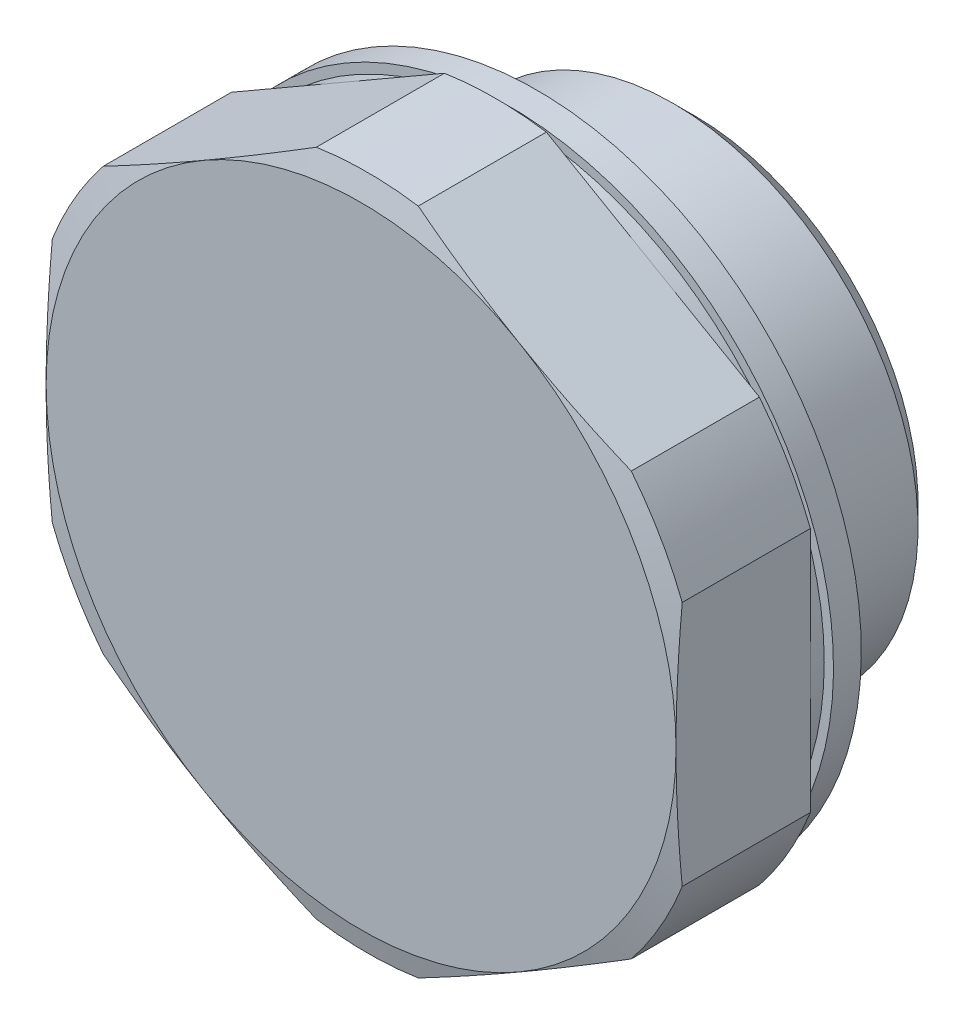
ISO-10303-21;
HEADER;
FILE_DESCRIPTION(('STEP AP214'),'2;1');
FILE_NAME('part.step','',(''),(''),'','','');
FILE_SCHEMA(('AUTOMOTIVE_DESIGN { 1 0 10303 214 1 1 1 1 }'));
ENDSEC;
DATA;
#1=APPLICATION_CONTEXT('core data for automotive mechanical design processes');
#2=APPLICATION_PROTOCOL_DEFINITION('international standard','automotive_design',2000,#1);
#3=PRODUCT_CONTEXT('',#1,'mechanical');
#4=PRODUCT('Part','Part','',(#3));
#5=PRODUCT_RELATED_PRODUCT_CATEGORY('part','',(#4));
#6=PRODUCT_DEFINITION_FORMATION('','',#4);
#7=PRODUCT_DEFINITION_CONTEXT('part definition',#1,'design');
#8=PRODUCT_DEFINITION('design','',#6,#7);
#9=PRODUCT_DEFINITION_SHAPE('','',#8);
#10=(LENGTH_UNIT() NAMED_UNIT(*) SI_UNIT(.MILLI.,.METRE.));
#11=(NAMED_UNIT(*) PLANE_ANGLE_UNIT() SI_UNIT($,.RADIAN.));
#12=(NAMED_UNIT(*) SI_UNIT($,.STERADIAN.) SOLID_ANGLE_UNIT());
#13=UNCERTAINTY_MEASURE_WITH_UNIT(LENGTH_MEASURE(1.E-05),#10,'distance_accuracy_value','');
#14=(GEOMETRIC_REPRESENTATION_CONTEXT(3) GLOBAL_UNCERTAINTY_ASSIGNED_CONTEXT((#13)) GLOBAL_UNIT_ASSIGNED_CONTEXT((#10,
#11,#12)) REPRESENTATION_CONTEXT('',''));
#15=CARTESIAN_POINT('',(0.,0.,0.));
#16=DIRECTION('',(0.,0.,1.));
#17=DIRECTION('',(1.,0.,0.));
#18=AXIS2_PLACEMENT_3D('',#15,#16,#17);
#19=CARTESIAN_POINT('',(0.,0.,-2.99999999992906));
#20=DIRECTION('',(0.,0.,-1.));
#21=DIRECTION('',(0.,1.,0.));
#22=AXIS2_PLACEMENT_3D('',#19,#20,#21);
#23=CONICAL_SURFACE('',#22,6.50000000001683,1.02974425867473);
#24=CARTESIAN_POINT('',(0.,0.,0.905594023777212));
#25=VERTEX_POINT('',#24);
#26=VERTEX_LOOP('',#25);
#27=FACE_BOUND('',#26,.T.);
#28=CARTESIAN_POINT('',(0.,0.,-3.));
#29=DIRECTION('',(0.,0.,1.));
#30=DIRECTION('',(0.,-1.,0.));
#31=AXIS2_PLACEMENT_3D('',#28,#29,#30);
#32=CIRCLE('',#31,6.5);
#33=CARTESIAN_POINT('',(0.,-6.5,-3.));
#34=VERTEX_POINT('',#33);
#35=EDGE_CURVE('E410',#34,#34,#32,.F.);
#36=ORIENTED_EDGE('',*,*,#35,.T.);
#37=EDGE_LOOP('',(#36));
#38=FACE_BOUND('',#37,.T.);
#39=ADVANCED_FACE('F14',(#27,#38),#23,.F.);
#40=CARTESIAN_POINT('',(0.,0.,-10.));
#41=DIRECTION('',(0.,0.,1.));
#42=DIRECTION('',(0.,-1.,0.));
#43=AXIS2_PLACEMENT_3D('',#40,#41,#42);
#44=CYLINDRICAL_SURFACE('',#43,6.5);
#45=CARTESIAN_POINT('',(0.,0.,-10.));
#46=DIRECTION('',(0.,0.,1.));
#47=DIRECTION('',(0.,-1.,0.));
#48=AXIS2_PLACEMENT_3D('',#45,#46,#47);
#49=CIRCLE('',#48,6.5);
#50=CARTESIAN_POINT('',(0.,-6.5,-10.));
#51=VERTEX_POINT('',#50);
#52=EDGE_CURVE('E17',#51,#51,#49,.F.);
#53=ORIENTED_EDGE('',*,*,#52,.T.);
#54=EDGE_LOOP('',(#53));
#55=FACE_BOUND('',#54,.T.);
#56=ORIENTED_EDGE('',*,*,#35,.F.);
#57=EDGE_LOOP('',(#56));
#58=FACE_BOUND('',#57,.T.);
#59=ADVANCED_FACE('F777',(#55,#58),#44,.F.);
#60=CARTESIAN_POINT('',(12.0585,0.,-10.));
#61=DIRECTION('',(0.,0.,1.));
#62=DIRECTION('',(0.,-1.,0.));
#63=AXIS2_PLACEMENT_3D('',#60,#61,#62);
#64=PLANE('',#63);
#65=CARTESIAN_POINT('',(0.,0.,-10.));
#66=DIRECTION('',(0.,0.,1.));
#67=DIRECTION('',(0.,-1.,0.));
#68=AXIS2_PLACEMENT_3D('',#65,#66,#67);
#69=CIRCLE('',#68,12.0585);
#70=CARTESIAN_POINT('',(0.,-12.0585,-10.));
#71=VERTEX_POINT('',#70);
#72=EDGE_CURVE('E407',#71,#71,#69,.T.);
#73=ORIENTED_EDGE('',*,*,#72,.F.);
#74=EDGE_LOOP('',(#73));
#75=FACE_BOUND('',#74,.T.);
#76=ORIENTED_EDGE('',*,*,#52,.F.);
#77=EDGE_LOOP('',(#76));
#78=FACE_BOUND('',#77,.T.);
#79=ADVANCED_FACE('F768',(#75,#78),#64,.F.);
#80=CARTESIAN_POINT('',(0.,0.,-8.838));
#81=DIRECTION('',(0.,0.,1.));
#82=DIRECTION('',(0.,-1.,0.));
#83=AXIS2_PLACEMENT_3D('',#80,#81,#82);
#84=CONICAL_SURFACE('',#83,13.2205,0.785398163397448);
#85=CARTESIAN_POINT('',(0.,0.,-8.838));
#86=DIRECTION('',(0.,0.,1.));
#87=DIRECTION('',(0.,-1.,0.));
#88=AXIS2_PLACEMENT_3D('',#85,#86,#87);
#89=CIRCLE('',#88,13.2205);
#90=CARTESIAN_POINT('',(0.,-13.2205,-8.838));
#91=VERTEX_POINT('',#90);
#92=EDGE_CURVE('E402',#91,#91,#89,.T.);
#93=ORIENTED_EDGE('',*,*,#92,.F.);
#94=EDGE_LOOP('',(#93));
#95=FACE_BOUND('',#94,.T.);
#96=ORIENTED_EDGE('',*,*,#72,.T.);
#97=EDGE_LOOP('',(#96));
#98=FACE_BOUND('',#97,.T.);
#99=ADVANCED_FACE('F759',(#95,#98),#84,.T.);
#100=CARTESIAN_POINT('',(0.,0.,-10.));
#101=DIRECTION('',(0.,0.,1.));
#102=DIRECTION('',(0.,-1.,0.));
#103=AXIS2_PLACEMENT_3D('',#100,#101,#102);
#104=CYLINDRICAL_SURFACE('',#103,13.2205);
#105=CARTESIAN_POINT('',(0.,0.,-3.67088101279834));
#106=DIRECTION('',(0.,0.,-1.));
#107=DIRECTION('',(0.,1.,0.));
#108=AXIS2_PLACEMENT_3D('',#105,#106,#107);
#109=CIRCLE('',#108,13.2205);
#110=CARTESIAN_POINT('',(0.,13.2205,-3.67088101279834));
#111=VERTEX_POINT('',#110);
#112=EDGE_CURVE('E398',#111,#111,#109,.F.);
#113=ORIENTED_EDGE('',*,*,#112,.F.);
#114=EDGE_LOOP('',(#113));
#115=FACE_BOUND('',#114,.T.);
#116=ORIENTED_EDGE('',*,*,#92,.T.);
#117=EDGE_LOOP('',(#116));
#118=FACE_BOUND('',#117,.T.);
#119=ADVANCED_FACE('F750',(#115,#118),#104,.T.);
#120=CARTESIAN_POINT('',(0.,0.,-3.67088101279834));
#121=DIRECTION('',(0.,0.,-1.));
#122=DIRECTION('',(0.,1.,0.));
#123=AXIS2_PLACEMENT_3D('',#120,#121,#122);
#124=CONICAL_SURFACE('',#123,13.2205,1.0471975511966);
#125=CARTESIAN_POINT('',(0.,0.,-3.));
#126=DIRECTION('',(0.,0.,-1.));
#127=DIRECTION('',(0.,1.,0.));
#128=AXIS2_PLACEMENT_3D('',#125,#126,#127);
#129=CIRCLE('',#128,12.0585);
#130=CARTESIAN_POINT('',(0.,12.0585,-3.));
#131=VERTEX_POINT('',#130);
#132=EDGE_CURVE('E401',#131,#131,#129,.T.);
#133=ORIENTED_EDGE('',*,*,#132,.T.);
#134=EDGE_LOOP('',(#133));
#135=FACE_BOUND('',#134,.T.);
#136=ORIENTED_EDGE('',*,*,#112,.T.);
#137=EDGE_LOOP('',(#136));
#138=FACE_BOUND('',#137,.T.);
#139=ADVANCED_FACE('F741',(#135,#138),#124,.T.);
#140=CARTESIAN_POINT('',(11.25,0.,-3.));
#141=DIRECTION('',(0.,0.,-1.));
#142=DIRECTION('',(0.,1.,0.));
#143=AXIS2_PLACEMENT_3D('',#140,#141,#142);
#144=PLANE('',#143);
#145=CARTESIAN_POINT('',(0.,0.,-3.));
#146=DIRECTION('',(0.,0.,1.));
#147=DIRECTION('',(0.,-1.,0.));
#148=AXIS2_PLACEMENT_3D('',#145,#146,#147);
#149=CIRCLE('',#148,11.25);
#150=CARTESIAN_POINT('',(0.,-11.25,-3.));
#151=VERTEX_POINT('',#150);
#152=EDGE_CURVE('E425',#151,#151,#149,.T.);
#153=ORIENTED_EDGE('',*,*,#152,.F.);
#154=EDGE_LOOP('',(#153));
#155=FACE_BOUND('',#154,.T.);
#156=ORIENTED_EDGE('',*,*,#132,.F.);
#157=EDGE_LOOP('',(#156));
#158=FACE_BOUND('',#157,.T.);
#159=ADVANCED_FACE('F732',(#155,#158),#144,.F.);
#160=CARTESIAN_POINT('',(0.,0.,0.));
#161=DIRECTION('',(0.,0.,1.));
#162=DIRECTION('',(0.,-1.,0.));
#163=AXIS2_PLACEMENT_3D('',#160,#161,#162);
#164=CONICAL_SURFACE('',#163,12.5,0.394791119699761);
#165=CARTESIAN_POINT('',(0.,0.,0.));
#166=DIRECTION('',(0.,0.,1.));
#167=DIRECTION('',(0.,-1.,0.));
#168=AXIS2_PLACEMENT_3D('',#165,#166,#167);
#169=CIRCLE('',#168,12.5);
#170=CARTESIAN_POINT('',(0.,-12.5,0.));
#171=VERTEX_POINT('',#170);
#172=EDGE_CURVE('E428',#171,#171,#169,.F.);
#173=ORIENTED_EDGE('',*,*,#172,.T.);
#174=EDGE_LOOP('',(#173));
#175=FACE_BOUND('',#174,.T.);
#176=ORIENTED_EDGE('',*,*,#152,.T.);
#177=EDGE_LOOP('',(#176));
#178=FACE_BOUND('',#177,.T.);
#179=ADVANCED_FACE('F723',(#175,#178),#164,.T.);
#180=CARTESIAN_POINT('',(17.,0.,0.));
#181=DIRECTION('',(0.,0.,1.));
#182=DIRECTION('',(0.,-1.,0.));
#183=AXIS2_PLACEMENT_3D('',#180,#181,#182);
#184=PLANE('',#183);
#185=CARTESIAN_POINT('',(0.,0.,0.));
#186=DIRECTION('',(0.,0.,1.));
#187=DIRECTION('',(0.,-1.,0.));
#188=AXIS2_PLACEMENT_3D('',#185,#186,#187);
#189=CIRCLE('',#188,13.2205);
#190=CARTESIAN_POINT('',(0.,-13.2205,0.));
#191=VERTEX_POINT('',#190);
#192=EDGE_CURVE('E431',#191,#191,#189,.F.);
#193=ORIENTED_EDGE('',*,*,#192,.T.);
#194=EDGE_LOOP('',(#193));
#195=FACE_BOUND('',#194,.T.);
#196=ORIENTED_EDGE('',*,*,#172,.F.);
#197=EDGE_LOOP('',(#196));
#198=FACE_BOUND('',#197,.T.);
#199=ADVANCED_FACE('F714',(#195,#198),#184,.F.);
#200=CARTESIAN_POINT('',(0.,0.,-1.5));
#201=DIRECTION('',(0.,0.,1.));
#202=DIRECTION('',(0.,-1.,0.));
#203=AXIS2_PLACEMENT_3D('',#200,#201,#202);
#204=CYLINDRICAL_SURFACE('',#203,13.2205);
#205=ORIENTED_EDGE('',*,*,#192,.F.);
#206=EDGE_LOOP('',(#205));
#207=FACE_BOUND('',#206,.T.);
#208=CARTESIAN_POINT('',(0.,0.,-1.5));
#209=DIRECTION('',(0.,0.,1.));
#210=DIRECTION('',(0.,-1.,0.));
#211=AXIS2_PLACEMENT_3D('',#208,#209,#210);
#212=CIRCLE('',#211,13.2205);
#213=CARTESIAN_POINT('',(0.,-13.2205,-1.5));
#214=VERTEX_POINT('',#213);
#215=EDGE_CURVE('E434',#214,#214,#212,.T.);
#216=ORIENTED_EDGE('',*,*,#215,.F.);
#217=EDGE_LOOP('',(#216));
#218=FACE_BOUND('',#217,.T.);
#219=ADVANCED_FACE('F705',(#207,#218),#204,.F.);
#220=CARTESIAN_POINT('',(13.2205,0.,-1.5));
#221=DIRECTION('',(0.,0.,-1.));
#222=DIRECTION('',(0.,1.,0.));
#223=AXIS2_PLACEMENT_3D('',#220,#221,#222);
#224=PLANE('',#223);
#225=ORIENTED_EDGE('',*,*,#215,.T.);
#226=EDGE_LOOP('',(#225));
#227=FACE_BOUND('',#226,.T.);
#228=CARTESIAN_POINT('',(0.,0.,-1.5));
#229=DIRECTION('',(0.,0.,1.));
#230=DIRECTION('',(0.,-1.,0.));
#231=AXIS2_PLACEMENT_3D('',#228,#229,#230);
#232=CIRCLE('',#231,17.5);
#233=CARTESIAN_POINT('',(0.,-17.5,-1.5));
#234=VERTEX_POINT('',#233);
#235=EDGE_CURVE('E437',#234,#234,#232,.T.);
#236=ORIENTED_EDGE('',*,*,#235,.F.);
#237=EDGE_LOOP('',(#236));
#238=FACE_BOUND('',#237,.T.);
#239=ADVANCED_FACE('F696',(#227,#238),#224,.T.);
#240=CARTESIAN_POINT('',(0.,0.,-1.5));
#241=DIRECTION('',(0.,0.,1.));
#242=DIRECTION('',(0.,-1.,0.));
#243=AXIS2_PLACEMENT_3D('',#240,#241,#242);
#244=CYLINDRICAL_SURFACE('',#243,17.5);
#245=ORIENTED_EDGE('',*,*,#235,.T.);
#246=EDGE_LOOP('',(#245));
#247=FACE_BOUND('',#246,.T.);
#248=CARTESIAN_POINT('',(0.,0.,0.));
#249=DIRECTION('',(0.,0.,1.));
#250=DIRECTION('',(0.,-1.,0.));
#251=AXIS2_PLACEMENT_3D('',#248,#249,#250);
#252=CIRCLE('',#251,17.5);
#253=CARTESIAN_POINT('',(0.,-17.5,0.));
#254=VERTEX_POINT('',#253);
#255=EDGE_CURVE('E440',#254,#254,#252,.T.);
#256=ORIENTED_EDGE('',*,*,#255,.F.);
#257=EDGE_LOOP('',(#256));
#258=FACE_BOUND('',#257,.T.);
#259=ADVANCED_FACE('F687',(#247,#258),#244,.T.);
#260=CARTESIAN_POINT('',(17.5,0.,0.));
#261=DIRECTION('',(0.,0.,1.));
#262=DIRECTION('',(0.,-1.,0.));
#263=AXIS2_PLACEMENT_3D('',#260,#261,#262);
#264=PLANE('',#263);
#265=ORIENTED_EDGE('',*,*,#255,.T.);
#266=EDGE_LOOP('',(#265));
#267=FACE_BOUND('',#266,.T.);
#268=CARTESIAN_POINT('',(0.,0.,0.));
#269=DIRECTION('',(0.,0.,1.));
#270=DIRECTION('',(0.,-1.,0.));
#271=AXIS2_PLACEMENT_3D('',#268,#269,#270);
#272=CIRCLE('',#271,17.);
#273=CARTESIAN_POINT('',(0.,-17.,0.));
#274=VERTEX_POINT('',#273);
#275=EDGE_CURVE('E443',#274,#274,#272,.T.);
#276=ORIENTED_EDGE('',*,*,#275,.F.);
#277=EDGE_LOOP('',(#276));
#278=FACE_BOUND('',#277,.T.);
#279=ADVANCED_FACE('F679',(#267,#278),#264,.T.);
#280=CARTESIAN_POINT('',(0.,0.,-10.));
#281=DIRECTION('',(0.,0.,1.));
#282=DIRECTION('',(0.,-1.,0.));
#283=AXIS2_PLACEMENT_3D('',#280,#281,#282);
#284=CYLINDRICAL_SURFACE('',#283,17.);
#285=CARTESIAN_POINT('',(0.,0.,0.75));
#286=DIRECTION('',(0.,0.,1.));
#287=DIRECTION('',(0.,-1.,0.));
#288=AXIS2_PLACEMENT_3D('',#285,#286,#287);
#289=CIRCLE('',#288,17.);
#290=CARTESIAN_POINT('',(-8.5,14.7224318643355,0.75));
#291=VERTEX_POINT('',#290);
#292=CARTESIAN_POINT('',(8.5,14.7224318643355,0.75));
#293=VERTEX_POINT('',#292);
#294=EDGE_CURVE('E450',#291,#293,#289,.F.);
#295=ORIENTED_EDGE('',*,*,#294,.T.);
#296=CARTESIAN_POINT('',(0.,0.,0.75));
#297=DIRECTION('',(0.,0.,1.));
#298=DIRECTION('',(0.,-1.,0.));
#299=AXIS2_PLACEMENT_3D('',#296,#297,#298);
#300=CIRCLE('',#299,17.);
#301=CARTESIAN_POINT('',(17.,0.,0.75));
#302=VERTEX_POINT('',#301);
#303=EDGE_CURVE('E453',#293,#302,#300,.F.);
#304=ORIENTED_EDGE('',*,*,#303,.T.);
#305=CARTESIAN_POINT('',(0.,0.,0.75));
#306=DIRECTION('',(0.,0.,1.));
#307=DIRECTION('',(0.,-1.,0.));
#308=AXIS2_PLACEMENT_3D('',#305,#306,#307);
#309=CIRCLE('',#308,17.);
#310=CARTESIAN_POINT('',(8.5,-14.7224318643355,0.75));
#311=VERTEX_POINT('',#310);
#312=EDGE_CURVE('E456',#302,#311,#309,.F.);
#313=ORIENTED_EDGE('',*,*,#312,.T.);
#314=CARTESIAN_POINT('',(0.,0.,0.75));
#315=DIRECTION('',(0.,0.,1.));
#316=DIRECTION('',(0.,-1.,0.));
#317=AXIS2_PLACEMENT_3D('',#314,#315,#316);
#318=CIRCLE('',#317,17.);
#319=CARTESIAN_POINT('',(-8.5,-14.7224318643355,0.75));
#320=VERTEX_POINT('',#319);
#321=EDGE_CURVE('E459',#311,#320,#318,.F.);
#322=ORIENTED_EDGE('',*,*,#321,.T.);
#323=CARTESIAN_POINT('',(0.,0.,0.75));
#324=DIRECTION('',(0.,0.,1.));
#325=DIRECTION('',(0.,-1.,0.));
#326=AXIS2_PLACEMENT_3D('',#323,#324,#325);
#327=CIRCLE('',#326,17.);
#328=CARTESIAN_POINT('',(-17.,0.,0.75));
#329=VERTEX_POINT('',#328);
#330=EDGE_CURVE('E136',#320,#329,#327,.F.);
#331=ORIENTED_EDGE('',*,*,#330,.T.);
#332=CARTESIAN_POINT('',(0.,0.,0.75));
#333=DIRECTION('',(0.,0.,1.));
#334=DIRECTION('',(0.,-1.,0.));
#335=AXIS2_PLACEMENT_3D('',#332,#333,#334);
#336=CIRCLE('',#335,17.);
#337=EDGE_CURVE('E447',#329,#291,#336,.F.);
#338=ORIENTED_EDGE('',*,*,#337,.T.);
#339=EDGE_LOOP('',(#295,#304,#313,#322,#331,#338));
#340=FACE_BOUND('',#339,.T.);
#341=ORIENTED_EDGE('',*,*,#275,.T.);
#342=EDGE_LOOP('',(#341));
#343=FACE_BOUND('',#342,.T.);
#344=ADVANCED_FACE('F480',(#340,#343),#284,.T.);
#345=CARTESIAN_POINT('',(21.25,0.,0.75));
#346=DIRECTION('',(0.,0.,1.));
#347=DIRECTION('',(0.,-1.,0.));
#348=AXIS2_PLACEMENT_3D('',#345,#346,#347);
#349=PLANE('',#348);
#350=DIRECTION('',(0.,-1.,0.));
#351=VECTOR('',#350,1.);
#352=CARTESIAN_POINT('',(-17.,9.81495457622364,0.75));
#353=LINE('',#352,#351);
#354=CARTESIAN_POINT('',(-17.,-6.63795902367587,0.75));
#355=VERTEX_POINT('',#354);
#356=EDGE_CURVE('E387',#329,#355,#353,.T.);
#357=ORIENTED_EDGE('',*,*,#356,.F.);
#358=ORIENTED_EDGE('',*,*,#330,.F.);
#359=DIRECTION('',(0.866025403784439,-0.5,0.));
#360=VECTOR('',#359,1.);
#361=CARTESIAN_POINT('',(-17.,-9.81495457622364,0.75));
#362=LINE('',#361,#360);
#363=CARTESIAN_POINT('',(-14.2486411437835,-11.4034523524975,0.75));
#364=VERTEX_POINT('',#363);
#365=EDGE_CURVE('E391',#364,#320,#362,.T.);
#366=ORIENTED_EDGE('',*,*,#365,.F.);
#367=CARTESIAN_POINT('',(0.,0.,0.75));
#368=DIRECTION('',(0.,0.,-1.));
#369=DIRECTION('',(0.,1.,0.));
#370=AXIS2_PLACEMENT_3D('',#367,#368,#369);
#371=CIRCLE('',#370,18.25);
#372=EDGE_CURVE('E397',#355,#364,#371,.F.);
#373=ORIENTED_EDGE('',*,*,#372,.F.);
#374=EDGE_LOOP('',(#357,#358,#366,#373));
#375=FACE_BOUND('',#374,.T.);
#376=ADVANCED_FACE('F663',(#375),#349,.F.);
#377=CARTESIAN_POINT('',(21.25,0.,0.75));
#378=DIRECTION('',(0.,0.,1.));
#379=DIRECTION('',(0.,-1.,0.));
#380=AXIS2_PLACEMENT_3D('',#377,#378,#379);
#381=PLANE('',#380);
#382=DIRECTION('',(-0.866025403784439,-0.5,0.));
#383=VECTOR('',#382,1.);
#384=CARTESIAN_POINT('',(0.,19.6299091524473,0.75));
#385=LINE('',#384,#383);
#386=CARTESIAN_POINT('',(-14.2486411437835,11.4034523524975,0.75));
#387=VERTEX_POINT('',#386);
#388=EDGE_CURVE('E379',#291,#387,#385,.T.);
#389=ORIENTED_EDGE('',*,*,#388,.F.);
#390=ORIENTED_EDGE('',*,*,#337,.F.);
#391=DIRECTION('',(0.,-1.,0.));
#392=VECTOR('',#391,1.);
#393=CARTESIAN_POINT('',(-17.,9.81495457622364,0.75));
#394=LINE('',#393,#392);
#395=CARTESIAN_POINT('',(-17.,6.63795902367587,0.75));
#396=VERTEX_POINT('',#395);
#397=EDGE_CURVE('E383',#396,#329,#394,.T.);
#398=ORIENTED_EDGE('',*,*,#397,.F.);
#399=CARTESIAN_POINT('',(0.,0.,0.75));
#400=DIRECTION('',(0.,0.,-1.));
#401=DIRECTION('',(0.,1.,0.));
#402=AXIS2_PLACEMENT_3D('',#399,#400,#401);
#403=CIRCLE('',#402,18.25);
#404=EDGE_CURVE('E390',#387,#396,#403,.F.);
#405=ORIENTED_EDGE('',*,*,#404,.F.);
#406=EDGE_LOOP('',(#389,#390,#398,#405));
#407=FACE_BOUND('',#406,.T.);
#408=ADVANCED_FACE('F655',(#407),#381,.F.);
#409=CARTESIAN_POINT('',(21.25,0.,0.75));
#410=DIRECTION('',(0.,0.,1.));
#411=DIRECTION('',(0.,-1.,0.));
#412=AXIS2_PLACEMENT_3D('',#409,#410,#411);
#413=PLANE('',#412);
#414=DIRECTION('',(-0.866025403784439,0.5,0.));
#415=VECTOR('',#414,1.);
#416=CARTESIAN_POINT('',(17.,9.81495457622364,0.75));
#417=LINE('',#416,#415);
#418=CARTESIAN_POINT('',(2.75135885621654,18.0414113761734,0.75));
#419=VERTEX_POINT('',#418);
#420=EDGE_CURVE('E371',#293,#419,#417,.T.);
#421=ORIENTED_EDGE('',*,*,#420,.F.);
#422=ORIENTED_EDGE('',*,*,#294,.F.);
#423=DIRECTION('',(-0.866025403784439,-0.5,0.));
#424=VECTOR('',#423,1.);
#425=CARTESIAN_POINT('',(0.,19.6299091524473,0.75));
#426=LINE('',#425,#424);
#427=CARTESIAN_POINT('',(-2.75135885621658,18.0414113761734,0.75));
#428=VERTEX_POINT('',#427);
#429=EDGE_CURVE('E375',#428,#291,#426,.T.);
#430=ORIENTED_EDGE('',*,*,#429,.F.);
#431=CARTESIAN_POINT('',(0.,0.,0.75));
#432=DIRECTION('',(0.,0.,-1.));
#433=DIRECTION('',(0.,1.,0.));
#434=AXIS2_PLACEMENT_3D('',#431,#432,#433);
#435=CIRCLE('',#434,18.25);
#436=EDGE_CURVE('E382',#419,#428,#435,.F.);
#437=ORIENTED_EDGE('',*,*,#436,.F.);
#438=EDGE_LOOP('',(#421,#422,#430,#437));
#439=FACE_BOUND('',#438,.T.);
#440=ADVANCED_FACE('F485',(#439),#413,.F.);
#441=CARTESIAN_POINT('',(21.25,0.,0.75));
#442=DIRECTION('',(0.,0.,1.));
#443=DIRECTION('',(0.,-1.,0.));
#444=AXIS2_PLACEMENT_3D('',#441,#442,#443);
#445=PLANE('',#444);
#446=DIRECTION('',(0.,1.,0.));
#447=VECTOR('',#446,1.);
#448=CARTESIAN_POINT('',(17.,-9.81495457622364,0.75));
#449=LINE('',#448,#447);
#450=CARTESIAN_POINT('',(17.,6.63795902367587,0.75));
#451=VERTEX_POINT('',#450);
#452=EDGE_CURVE('E365',#302,#451,#449,.T.);
#453=ORIENTED_EDGE('',*,*,#452,.F.);
#454=ORIENTED_EDGE('',*,*,#303,.F.);
#455=DIRECTION('',(-0.866025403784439,0.5,0.));
#456=VECTOR('',#455,1.);
#457=CARTESIAN_POINT('',(17.,9.81495457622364,0.75));
#458=LINE('',#457,#456);
#459=CARTESIAN_POINT('',(14.2486411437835,11.4034523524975,0.75));
#460=VERTEX_POINT('',#459);
#461=EDGE_CURVE('E367',#460,#293,#458,.T.);
#462=ORIENTED_EDGE('',*,*,#461,.F.);
#463=CARTESIAN_POINT('',(0.,0.,0.75));
#464=DIRECTION('',(0.,0.,-1.));
#465=DIRECTION('',(0.,1.,0.));
#466=AXIS2_PLACEMENT_3D('',#463,#464,#465);
#467=CIRCLE('',#466,18.25);
#468=EDGE_CURVE('E374',#451,#460,#467,.F.);
#469=ORIENTED_EDGE('',*,*,#468,.F.);
#470=EDGE_LOOP('',(#453,#454,#462,#469));
#471=FACE_BOUND('',#470,.T.);
#472=ADVANCED_FACE('F478',(#471),#445,.F.);
#473=CARTESIAN_POINT('',(21.25,0.,0.75));
#474=DIRECTION('',(0.,0.,1.));
#475=DIRECTION('',(0.,-1.,0.));
#476=AXIS2_PLACEMENT_3D('',#473,#474,#475);
#477=PLANE('',#476);
#478=DIRECTION('',(0.866025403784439,0.5,0.));
#479=VECTOR('',#478,1.);
#480=CARTESIAN_POINT('',(0.,-19.6299091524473,0.75));
#481=LINE('',#480,#479);
#482=CARTESIAN_POINT('',(14.2486411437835,-11.4034523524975,0.75));
#483=VERTEX_POINT('',#482);
#484=EDGE_CURVE('E362',#311,#483,#481,.T.);
#485=ORIENTED_EDGE('',*,*,#484,.F.);
#486=ORIENTED_EDGE('',*,*,#312,.F.);
#487=DIRECTION('',(0.,1.,0.));
#488=VECTOR('',#487,1.);
#489=CARTESIAN_POINT('',(17.,-9.81495457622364,0.75));
#490=LINE('',#489,#488);
#491=CARTESIAN_POINT('',(17.,-6.63795902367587,0.75));
#492=VERTEX_POINT('',#491);
#493=EDGE_CURVE('E163',#492,#302,#490,.T.);
#494=ORIENTED_EDGE('',*,*,#493,.F.);
#495=CARTESIAN_POINT('',(0.,0.,0.75));
#496=DIRECTION('',(0.,0.,-1.));
#497=DIRECTION('',(0.,1.,0.));
#498=AXIS2_PLACEMENT_3D('',#495,#496,#497);
#499=CIRCLE('',#498,18.25);
#500=EDGE_CURVE('E159',#483,#492,#499,.F.);
#501=ORIENTED_EDGE('',*,*,#500,.F.);
#502=EDGE_LOOP('',(#485,#486,#494,#501));
#503=FACE_BOUND('',#502,.T.);
#504=ADVANCED_FACE('F631',(#503),#477,.F.);
#505=CARTESIAN_POINT('',(21.25,0.,0.75));
#506=DIRECTION('',(0.,0.,1.));
#507=DIRECTION('',(0.,-1.,0.));
#508=AXIS2_PLACEMENT_3D('',#505,#506,#507);
#509=PLANE('',#508);
#510=DIRECTION('',(0.866025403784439,-0.5,0.));
#511=VECTOR('',#510,1.);
#512=CARTESIAN_POINT('',(-17.,-9.81495457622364,0.75));
#513=LINE('',#512,#511);
#514=CARTESIAN_POINT('',(-2.75135885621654,-18.0414113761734,0.75));
#515=VERTEX_POINT('',#514);
#516=EDGE_CURVE('E395',#320,#515,#513,.T.);
#517=ORIENTED_EDGE('',*,*,#516,.F.);
#518=ORIENTED_EDGE('',*,*,#321,.F.);
#519=DIRECTION('',(0.866025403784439,0.5,0.));
#520=VECTOR('',#519,1.);
#521=CARTESIAN_POINT('',(0.,-19.6299091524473,0.75));
#522=LINE('',#521,#520);
#523=CARTESIAN_POINT('',(2.75135885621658,-18.0414113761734,0.75));
#524=VERTEX_POINT('',#523);
#525=EDGE_CURVE('E355',#524,#311,#522,.T.);
#526=ORIENTED_EDGE('',*,*,#525,.F.);
#527=CARTESIAN_POINT('',(0.,0.,0.75));
#528=DIRECTION('',(0.,0.,-1.));
#529=DIRECTION('',(0.,1.,0.));
#530=AXIS2_PLACEMENT_3D('',#527,#528,#529);
#531=CIRCLE('',#530,18.25);
#532=EDGE_CURVE('E461',#515,#524,#531,.F.);
#533=ORIENTED_EDGE('',*,*,#532,.F.);
#534=EDGE_LOOP('',(#517,#518,#526,#533));
#535=FACE_BOUND('',#534,.T.);
#536=ADVANCED_FACE('F624',(#535),#509,.F.);
#537=CARTESIAN_POINT('',(0.,0.,0.));
#538=DIRECTION('',(0.,0.,-1.));
#539=DIRECTION('',(0.,1.,0.));
#540=AXIS2_PLACEMENT_3D('',#537,#538,#539);
#541=CYLINDRICAL_SURFACE('',#540,18.25);
#542=CARTESIAN_POINT('',(0.,0.,7.6650635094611));
#543=DIRECTION('',(0.,0.,-1.));
#544=DIRECTION('',(0.,1.,0.));
#545=AXIS2_PLACEMENT_3D('',#542,#543,#544);
#546=CIRCLE('',#545,18.25);
#547=CARTESIAN_POINT('',(-2.75135885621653,-18.0414113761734,7.6650635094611));
#548=VERTEX_POINT('',#547);
#549=CARTESIAN_POINT('',(2.75135885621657,-18.0414113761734,7.6650635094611));
#550=VERTEX_POINT('',#549);
#551=EDGE_CURVE('E354',#548,#550,#546,.F.);
#552=ORIENTED_EDGE('',*,*,#551,.F.);
#553=DIRECTION('',(0.,0.,1.));
#554=VECTOR('',#553,1.);
#555=CARTESIAN_POINT('',(-2.75135885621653,-18.0414113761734,0.));
#556=LINE('',#555,#554);
#557=EDGE_CURVE('E359',#515,#548,#556,.T.);
#558=ORIENTED_EDGE('',*,*,#557,.F.);
#559=ORIENTED_EDGE('',*,*,#532,.T.);
#560=DIRECTION('',(0.,0.,1.));
#561=VECTOR('',#560,1.);
#562=CARTESIAN_POINT('',(2.75135885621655,-18.0414113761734,0.));
#563=LINE('',#562,#561);
#564=EDGE_CURVE('E352',#550,#524,#563,.F.);
#565=ORIENTED_EDGE('',*,*,#564,.F.);
#566=EDGE_LOOP('',(#552,#558,#559,#565));
#567=FACE_BOUND('',#566,.T.);
#568=ADVANCED_FACE('F508',(#567),#541,.T.);
#569=CARTESIAN_POINT('',(0.,0.,0.));
#570=DIRECTION('',(0.,0.,-1.));
#571=DIRECTION('',(0.,1.,0.));
#572=AXIS2_PLACEMENT_3D('',#569,#570,#571);
#573=CYLINDRICAL_SURFACE('',#572,18.25);
#574=CARTESIAN_POINT('',(0.,0.,7.6650635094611));
#575=DIRECTION('',(0.,0.,-1.));
#576=DIRECTION('',(0.,1.,0.));
#577=AXIS2_PLACEMENT_3D('',#574,#575,#576);
#578=CIRCLE('',#577,18.25);
#579=CARTESIAN_POINT('',(-17.,-6.63795902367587,7.6650635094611));
#580=VERTEX_POINT('',#579);
#581=CARTESIAN_POINT('',(-14.2486411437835,-11.4034523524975,7.6650635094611));
#582=VERTEX_POINT('',#581);
#583=EDGE_CURVE('E300',#580,#582,#578,.F.);
#584=ORIENTED_EDGE('',*,*,#583,.F.);
#585=DIRECTION('',(0.,0.,1.));
#586=VECTOR('',#585,1.);
#587=CARTESIAN_POINT('',(-17.,-6.63795902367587,0.));
#588=LINE('',#587,#586);
#589=EDGE_CURVE('E389',#355,#580,#588,.T.);
#590=ORIENTED_EDGE('',*,*,#589,.F.);
#591=ORIENTED_EDGE('',*,*,#372,.T.);
#592=DIRECTION('',(0.,0.,1.));
#593=VECTOR('',#592,1.);
#594=CARTESIAN_POINT('',(-14.2486411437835,-11.4034523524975,0.));
#595=LINE('',#594,#593);
#596=EDGE_CURVE('E394',#582,#364,#595,.F.);
#597=ORIENTED_EDGE('',*,*,#596,.F.);
#598=EDGE_LOOP('',(#584,#590,#591,#597));
#599=FACE_BOUND('',#598,.T.);
#600=ADVANCED_FACE('F283',(#599),#573,.T.);
#601=CARTESIAN_POINT('',(-17.,-9.81495457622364,0.));
#602=DIRECTION('',(-0.5,-0.866025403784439,0.));
#603=DIRECTION('',(0.866025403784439,-0.5,0.));
#604=AXIS2_PLACEMENT_3D('',#601,#602,#603);
#605=PLANE('',#604);
#606=ORIENTED_EDGE('',*,*,#596,.T.);
#607=ORIENTED_EDGE('',*,*,#365,.T.);
#608=ORIENTED_EDGE('',*,*,#516,.T.);
#609=ORIENTED_EDGE('',*,*,#557,.T.);
#610=CARTESIAN_POINT('',(-8.5,-14.7224318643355,8.));
#611=CARTESIAN_POINT('',(-8.25999022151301,-14.8610015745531,8.00000399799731));
#612=CARTESIAN_POINT('',(-8.01998341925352,-14.9995695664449,7.99818377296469));
#613=CARTESIAN_POINT('',(-7.54001229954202,-15.2766810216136,7.99092816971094));
#614=CARTESIAN_POINT('',(-7.30004798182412,-15.4152244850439,7.98549281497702));
#615=CARTESIAN_POINT('',(-6.58056492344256,-15.8306182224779,7.96382287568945));
#616=CARTESIAN_POINT('',(-6.10115984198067,-16.1074028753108,7.94222433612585));
#617=CARTESIAN_POINT('',(-5.14300219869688,-16.6605954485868,7.8853472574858));
#618=CARTESIAN_POINT('',(-4.66424959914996,-16.9370033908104,7.85006954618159));
#619=CARTESIAN_POINT('',(-3.70728012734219,-17.4895099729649,7.76682954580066));
#620=CARTESIAN_POINT('',(-3.22906374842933,-17.7656083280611,7.7188596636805));
#621=CARTESIAN_POINT('',(-2.75135885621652,-18.0414113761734,7.6650635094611));
#622=B_SPLINE_CURVE_WITH_KNOTS('',3,(#610,#611,#612,#613,#614,#615,#616,#617,#618,#619,#620,
#621),.UNSPECIFIED.,.F.,.F.,(4,2,2,2,2,4),(0.,0.831405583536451,1.66280576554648,
3.32458025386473,4.98625419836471,6.64892448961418),.UNSPECIFIED.);
#623=CARTESIAN_POINT('',(-8.5,-14.7224318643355,8.));
#624=VERTEX_POINT('',#623);
#625=EDGE_CURVE('E293',#624,#548,#622,.T.);
#626=ORIENTED_EDGE('',*,*,#625,.F.);
#627=CARTESIAN_POINT('',(-14.2486411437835,-11.4034523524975,7.6650635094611));
#628=CARTESIAN_POINT('',(-13.7709362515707,-11.6792554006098,7.7188596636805));
#629=CARTESIAN_POINT('',(-13.2927198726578,-11.955353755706,7.76682954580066));
#630=CARTESIAN_POINT('',(-12.3357504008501,-12.5078603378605,7.85006954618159));
#631=CARTESIAN_POINT('',(-11.8569978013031,-12.7842682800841,7.8853472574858));
#632=CARTESIAN_POINT('',(-10.8988401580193,-13.3374608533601,7.94222433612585));
#633=CARTESIAN_POINT('',(-10.4194350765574,-13.614245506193,7.96382287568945));
#634=CARTESIAN_POINT('',(-9.69995201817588,-14.029639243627,7.98549281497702));
#635=CARTESIAN_POINT('',(-9.45998770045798,-14.1681827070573,7.99092816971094));
#636=CARTESIAN_POINT('',(-8.98001658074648,-14.445294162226,7.99818377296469));
#637=CARTESIAN_POINT('',(-8.74000977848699,-14.5838621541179,8.00000399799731));
#638=CARTESIAN_POINT('',(-8.5,-14.7224318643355,8.));
#639=B_SPLINE_CURVE_WITH_KNOTS('',3,(#627,#628,#629,#630,#631,#632,#633,#634,#635,#636,#637,
#638),.UNSPECIFIED.,.F.,.F.,(4,2,2,2,2,4),(0.,1.66267029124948,3.32434423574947,
4.98611872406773,5.81751890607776,6.64892448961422),.UNSPECIFIED.);
#640=EDGE_CURVE('E287',#582,#624,#639,.T.);
#641=ORIENTED_EDGE('',*,*,#640,.F.);
#642=EDGE_LOOP('',(#606,#607,#608,#609,#626,#641));
#643=FACE_BOUND('',#642,.T.);
#644=ADVANCED_FACE('F278',(#643),#605,.T.);
#645=CARTESIAN_POINT('',(0.,0.,0.));
#646=DIRECTION('',(0.,0.,-1.));
#647=DIRECTION('',(0.,1.,0.));
#648=AXIS2_PLACEMENT_3D('',#645,#646,#647);
#649=CYLINDRICAL_SURFACE('',#648,18.25);
#650=CARTESIAN_POINT('',(0.,0.,7.6650635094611));
#651=DIRECTION('',(0.,0.,-1.));
#652=DIRECTION('',(0.,1.,0.));
#653=AXIS2_PLACEMENT_3D('',#650,#651,#652);
#654=CIRCLE('',#653,18.25);
#655=CARTESIAN_POINT('',(-14.2486411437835,11.4034523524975,7.66506350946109));
#656=VERTEX_POINT('',#655);
#657=CARTESIAN_POINT('',(-17.,6.6379590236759,7.6650635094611));
#658=VERTEX_POINT('',#657);
#659=EDGE_CURVE('E260',#656,#658,#654,.F.);
#660=ORIENTED_EDGE('',*,*,#659,.F.);
#661=DIRECTION('',(0.,0.,1.));
#662=VECTOR('',#661,1.);
#663=CARTESIAN_POINT('',(-14.2486411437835,11.4034523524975,0.));
#664=LINE('',#663,#662);
#665=EDGE_CURVE('E381',#387,#656,#664,.T.);
#666=ORIENTED_EDGE('',*,*,#665,.F.);
#667=ORIENTED_EDGE('',*,*,#404,.T.);
#668=DIRECTION('',(0.,0.,1.));
#669=VECTOR('',#668,1.);
#670=CARTESIAN_POINT('',(-17.,6.63795902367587,0.));
#671=LINE('',#670,#669);
#672=EDGE_CURVE('E386',#658,#396,#671,.F.);
#673=ORIENTED_EDGE('',*,*,#672,.F.);
#674=EDGE_LOOP('',(#660,#666,#667,#673));
#675=FACE_BOUND('',#674,.T.);
#676=ADVANCED_FACE('F273',(#675),#649,.T.);
#677=CARTESIAN_POINT('',(-17.,9.81495457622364,0.));
#678=DIRECTION('',(-1.,0.,0.));
#679=DIRECTION('',(0.,-1.,0.));
#680=AXIS2_PLACEMENT_3D('',#677,#678,#679);
#681=PLANE('',#680);
#682=ORIENTED_EDGE('',*,*,#672,.T.);
#683=ORIENTED_EDGE('',*,*,#397,.T.);
#684=ORIENTED_EDGE('',*,*,#356,.T.);
#685=ORIENTED_EDGE('',*,*,#589,.T.);
#686=CARTESIAN_POINT('',(-17.,0.,8.));
#687=CARTESIAN_POINT('',(-17.,-0.277139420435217,8.00000399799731));
#688=CARTESIAN_POINT('',(-17.,-0.554275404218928,7.99818377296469));
#689=CARTESIAN_POINT('',(-17.,-1.10849831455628,7.99092816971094));
#690=CARTESIAN_POINT('',(-17.,-1.38558524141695,7.98549281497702));
#691=CARTESIAN_POINT('',(-17.,-2.21637271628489,7.96382287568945));
#692=CARTESIAN_POINT('',(-17.,-2.76994202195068,7.94222433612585));
#693=CARTESIAN_POINT('',(-17.,-3.87632716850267,7.88534725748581));
#694=CARTESIAN_POINT('',(-17.,-4.42914305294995,7.85006954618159));
#695=CARTESIAN_POINT('',(-17.,-5.53415621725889,7.76682954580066));
#696=CARTESIAN_POINT('',(-17.,-6.08635292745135,7.71885966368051));
#697=CARTESIAN_POINT('',(-17.,-6.63795902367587,7.6650635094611));
#698=B_SPLINE_CURVE_WITH_KNOTS('',3,(#686,#687,#688,#689,#690,#691,#692,#693,#694,#695,#696,
#697),.UNSPECIFIED.,.F.,.F.,(4,2,2,2,2,4),(0.,0.831405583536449,1.66280576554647,
3.32458025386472,4.9862541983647,6.64892448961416),.UNSPECIFIED.);
#699=CARTESIAN_POINT('',(-17.,0.,8.));
#700=VERTEX_POINT('',#699);
#701=EDGE_CURVE('E261',#700,#580,#698,.T.);
#702=ORIENTED_EDGE('',*,*,#701,.F.);
#703=CARTESIAN_POINT('',(-17.,6.63795902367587,7.6650635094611));
#704=CARTESIAN_POINT('',(-17.,6.08635292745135,7.71885966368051));
#705=CARTESIAN_POINT('',(-17.,5.53415621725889,7.76682954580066));
#706=CARTESIAN_POINT('',(-17.,4.42914305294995,7.85006954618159));
#707=CARTESIAN_POINT('',(-17.,3.87632716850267,7.88534725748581));
#708=CARTESIAN_POINT('',(-17.,2.76994202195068,7.94222433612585));
#709=CARTESIAN_POINT('',(-17.,2.21637271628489,7.96382287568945));
#710=CARTESIAN_POINT('',(-17.,1.38558524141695,7.98549281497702));
#711=CARTESIAN_POINT('',(-17.,1.10849831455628,7.99092816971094));
#712=CARTESIAN_POINT('',(-17.,0.554275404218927,7.99818377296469));
#713=CARTESIAN_POINT('',(-17.,0.277139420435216,8.00000399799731));
#714=CARTESIAN_POINT('',(-17.,0.,8.));
#715=B_SPLINE_CURVE_WITH_KNOTS('',3,(#703,#704,#705,#706,#707,#708,#709,#710,#711,#712,#713,
#714),.UNSPECIFIED.,.F.,.F.,(4,2,2,2,2,4),(0.,1.66267029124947,3.32434423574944,
4.98611872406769,5.81751890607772,6.64892448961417),.UNSPECIFIED.);
#716=EDGE_CURVE('E253',#658,#700,#715,.T.);
#717=ORIENTED_EDGE('',*,*,#716,.F.);
#718=EDGE_LOOP('',(#682,#683,#684,#685,#702,#717));
#719=FACE_BOUND('',#718,.T.);
#720=ADVANCED_FACE('F267',(#719),#681,.T.);
#721=CARTESIAN_POINT('',(0.,0.,0.));
#722=DIRECTION('',(0.,0.,-1.));
#723=DIRECTION('',(0.,1.,0.));
#724=AXIS2_PLACEMENT_3D('',#721,#722,#723);
#725=CYLINDRICAL_SURFACE('',#724,18.25);
#726=CARTESIAN_POINT('',(0.,0.,7.6650635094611));
#727=DIRECTION('',(0.,0.,-1.));
#728=DIRECTION('',(0.,1.,0.));
#729=AXIS2_PLACEMENT_3D('',#726,#727,#728);
#730=CIRCLE('',#729,18.25);
#731=CARTESIAN_POINT('',(2.75135885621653,18.0414113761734,7.6650635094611));
#732=VERTEX_POINT('',#731);
#733=CARTESIAN_POINT('',(-2.75135885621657,18.0414113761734,7.6650635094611));
#734=VERTEX_POINT('',#733);
#735=EDGE_CURVE('E492',#732,#734,#730,.F.);
#736=ORIENTED_EDGE('',*,*,#735,.F.);
#737=DIRECTION('',(0.,0.,1.));
#738=VECTOR('',#737,1.);
#739=CARTESIAN_POINT('',(2.75135885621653,18.0414113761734,0.));
#740=LINE('',#739,#738);
#741=EDGE_CURVE('E373',#419,#732,#740,.T.);
#742=ORIENTED_EDGE('',*,*,#741,.F.);
#743=ORIENTED_EDGE('',*,*,#436,.T.);
#744=DIRECTION('',(0.,0.,1.));
#745=VECTOR('',#744,1.);
#746=CARTESIAN_POINT('',(-2.75135885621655,18.0414113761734,0.));
#747=LINE('',#746,#745);
#748=EDGE_CURVE('E378',#734,#428,#747,.F.);
#749=ORIENTED_EDGE('',*,*,#748,.F.);
#750=EDGE_LOOP('',(#736,#742,#743,#749));
#751=FACE_BOUND('',#750,.T.);
#752=ADVANCED_FACE('F272',(#751),#725,.T.);
#753=CARTESIAN_POINT('',(0.,19.6299091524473,0.));
#754=DIRECTION('',(-0.5,0.866025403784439,0.));
#755=DIRECTION('',(-0.866025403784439,-0.5,0.));
#756=AXIS2_PLACEMENT_3D('',#753,#754,#755);
#757=PLANE('',#756);
#758=ORIENTED_EDGE('',*,*,#748,.T.);
#759=ORIENTED_EDGE('',*,*,#429,.T.);
#760=ORIENTED_EDGE('',*,*,#388,.T.);
#761=ORIENTED_EDGE('',*,*,#665,.T.);
#762=CARTESIAN_POINT('',(-8.5,14.7224318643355,8.));
#763=CARTESIAN_POINT('',(-8.74000977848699,14.5838621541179,8.0000039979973));
#764=CARTESIAN_POINT('',(-8.98001658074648,14.445294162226,7.99818377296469));
#765=CARTESIAN_POINT('',(-9.45998770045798,14.1681827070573,7.99092816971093));
#766=CARTESIAN_POINT('',(-9.69995201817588,14.029639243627,7.98549281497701));
#767=CARTESIAN_POINT('',(-10.4194350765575,13.614245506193,7.96382287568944));
#768=CARTESIAN_POINT('',(-10.8988401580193,13.3374608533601,7.94222433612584));
#769=CARTESIAN_POINT('',(-11.8569978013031,12.7842682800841,7.8853472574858));
#770=CARTESIAN_POINT('',(-12.3357504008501,12.5078603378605,7.85006954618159));
#771=CARTESIAN_POINT('',(-13.2927198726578,11.955353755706,7.76682954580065));
#772=CARTESIAN_POINT('',(-13.7709362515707,11.6792554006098,7.71885966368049));
#773=CARTESIAN_POINT('',(-14.2486411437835,11.4034523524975,7.66506350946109));
#774=B_SPLINE_CURVE_WITH_KNOTS('',3,(#762,#763,#764,#765,#766,#767,#768,#769,#770,#771,#772,
#773),.UNSPECIFIED.,.F.,.F.,(4,2,2,2,2,4),(0.,0.831405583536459,1.66280576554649,
3.32458025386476,4.98625419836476,6.64892448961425),.UNSPECIFIED.);
#775=CARTESIAN_POINT('',(-8.5,14.7224318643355,8.));
#776=VERTEX_POINT('',#775);
#777=EDGE_CURVE('E247',#776,#656,#774,.T.);
#778=ORIENTED_EDGE('',*,*,#777,.F.);
#779=CARTESIAN_POINT('',(-2.75135885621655,18.0414113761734,7.6650635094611));
#780=CARTESIAN_POINT('',(-3.22906374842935,17.7656083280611,7.7188596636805));
#781=CARTESIAN_POINT('',(-3.70728012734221,17.4895099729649,7.76682954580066));
#782=CARTESIAN_POINT('',(-4.66424959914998,16.9370033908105,7.85006954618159));
#783=CARTESIAN_POINT('',(-5.14300219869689,16.6605954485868,7.8853472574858));
#784=CARTESIAN_POINT('',(-6.10115984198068,16.1074028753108,7.94222433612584));
#785=CARTESIAN_POINT('',(-6.58056492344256,15.8306182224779,7.96382287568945));
#786=CARTESIAN_POINT('',(-7.30004798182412,15.415224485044,7.98549281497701));
#787=CARTESIAN_POINT('',(-7.54001229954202,15.2766810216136,7.99092816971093));
#788=CARTESIAN_POINT('',(-8.01998341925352,14.9995695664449,7.99818377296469));
#789=CARTESIAN_POINT('',(-8.259990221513,14.8610015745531,8.0000039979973));
#790=CARTESIAN_POINT('',(-8.5,14.7224318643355,8.));
#791=B_SPLINE_CURVE_WITH_KNOTS('',3,(#779,#780,#781,#782,#783,#784,#785,#786,#787,#788,#789,
#790),.UNSPECIFIED.,.F.,.F.,(4,2,2,2,2,4),(0.,1.66267029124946,3.32434423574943,
4.98611872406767,5.8175189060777,6.64892448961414),.UNSPECIFIED.);
#792=EDGE_CURVE('E225',#734,#776,#791,.T.);
#793=ORIENTED_EDGE('',*,*,#792,.F.);
#794=EDGE_LOOP('',(#758,#759,#760,#761,#778,#793));
#795=FACE_BOUND('',#794,.T.);
#796=ADVANCED_FACE('F582',(#795),#757,.T.);
#797=CARTESIAN_POINT('',(0.,0.,0.));
#798=DIRECTION('',(0.,0.,-1.));
#799=DIRECTION('',(0.,1.,0.));
#800=AXIS2_PLACEMENT_3D('',#797,#798,#799);
#801=CYLINDRICAL_SURFACE('',#800,18.25);
#802=CARTESIAN_POINT('',(0.,0.,7.6650635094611));
#803=DIRECTION('',(0.,0.,-1.));
#804=DIRECTION('',(0.,1.,0.));
#805=AXIS2_PLACEMENT_3D('',#802,#803,#804);
#806=CIRCLE('',#805,18.25);
#807=CARTESIAN_POINT('',(17.,6.63795902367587,7.6650635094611));
#808=VERTEX_POINT('',#807);
#809=CARTESIAN_POINT('',(14.2486411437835,11.4034523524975,7.6650635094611));
#810=VERTEX_POINT('',#809);
#811=EDGE_CURVE('E224',#808,#810,#806,.F.);
#812=ORIENTED_EDGE('',*,*,#811,.F.);
#813=DIRECTION('',(0.,0.,1.));
#814=VECTOR('',#813,1.);
#815=CARTESIAN_POINT('',(17.,6.63795902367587,0.));
#816=LINE('',#815,#814);
#817=EDGE_CURVE('E164',#451,#808,#816,.T.);
#818=ORIENTED_EDGE('',*,*,#817,.F.);
#819=ORIENTED_EDGE('',*,*,#468,.T.);
#820=DIRECTION('',(0.,0.,1.));
#821=VECTOR('',#820,1.);
#822=CARTESIAN_POINT('',(14.2486411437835,11.4034523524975,0.));
#823=LINE('',#822,#821);
#824=EDGE_CURVE('E370',#810,#460,#823,.F.);
#825=ORIENTED_EDGE('',*,*,#824,.F.);
#826=EDGE_LOOP('',(#812,#818,#819,#825));
#827=FACE_BOUND('',#826,.T.);
#828=ADVANCED_FACE('F206',(#827),#801,.T.);
#829=CARTESIAN_POINT('',(17.,9.81495457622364,0.));
#830=DIRECTION('',(0.5,0.866025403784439,0.));
#831=DIRECTION('',(-0.866025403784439,0.5,0.));
#832=AXIS2_PLACEMENT_3D('',#829,#830,#831);
#833=PLANE('',#832);
#834=ORIENTED_EDGE('',*,*,#824,.T.);
#835=ORIENTED_EDGE('',*,*,#461,.T.);
#836=ORIENTED_EDGE('',*,*,#420,.T.);
#837=ORIENTED_EDGE('',*,*,#741,.T.);
#838=CARTESIAN_POINT('',(8.5,14.7224318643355,8.));
#839=CARTESIAN_POINT('',(8.25999022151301,14.8610015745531,8.0000039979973));
#840=CARTESIAN_POINT('',(8.01998341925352,14.9995695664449,7.99818377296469));
#841=CARTESIAN_POINT('',(7.54001229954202,15.2766810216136,7.99092816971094));
#842=CARTESIAN_POINT('',(7.30004798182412,15.4152244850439,7.98549281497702));
#843=CARTESIAN_POINT('',(6.58056492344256,15.8306182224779,7.96382287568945));
#844=CARTESIAN_POINT('',(6.10115984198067,16.1074028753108,7.94222433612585));
#845=CARTESIAN_POINT('',(5.14300219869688,16.6605954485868,7.8853472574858));
#846=CARTESIAN_POINT('',(4.66424959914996,16.9370033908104,7.85006954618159));
#847=CARTESIAN_POINT('',(3.70728012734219,17.4895099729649,7.76682954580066));
#848=CARTESIAN_POINT('',(3.22906374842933,17.7656083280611,7.7188596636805));
#849=CARTESIAN_POINT('',(2.75135885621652,18.0414113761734,7.6650635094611));
#850=B_SPLINE_CURVE_WITH_KNOTS('',3,(#838,#839,#840,#841,#842,#843,#844,#845,#846,#847,#848,
#849),.UNSPECIFIED.,.F.,.F.,(4,2,2,2,2,4),(0.,0.831405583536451,1.66280576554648,
3.32458025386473,4.98625419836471,6.64892448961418),.UNSPECIFIED.);
#851=CARTESIAN_POINT('',(8.5,14.7224318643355,8.));
#852=VERTEX_POINT('',#851);
#853=EDGE_CURVE('E216',#852,#732,#850,.T.);
#854=ORIENTED_EDGE('',*,*,#853,.F.);
#855=CARTESIAN_POINT('',(14.2486411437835,11.4034523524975,7.6650635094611));
#856=CARTESIAN_POINT('',(13.7709362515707,11.6792554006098,7.7188596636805));
#857=CARTESIAN_POINT('',(13.2927198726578,11.955353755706,7.76682954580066));
#858=CARTESIAN_POINT('',(12.3357504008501,12.5078603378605,7.85006954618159));
#859=CARTESIAN_POINT('',(11.8569978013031,12.7842682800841,7.8853472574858));
#860=CARTESIAN_POINT('',(10.8988401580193,13.3374608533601,7.94222433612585));
#861=CARTESIAN_POINT('',(10.4194350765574,13.614245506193,7.96382287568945));
#862=CARTESIAN_POINT('',(9.69995201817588,14.029639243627,7.98549281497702));
#863=CARTESIAN_POINT('',(9.45998770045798,14.1681827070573,7.99092816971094));
#864=CARTESIAN_POINT('',(8.98001658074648,14.445294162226,7.99818377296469));
#865=CARTESIAN_POINT('',(8.74000977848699,14.5838621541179,8.00000399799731));
#866=CARTESIAN_POINT('',(8.5,14.7224318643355,8.));
#867=B_SPLINE_CURVE_WITH_KNOTS('',3,(#855,#856,#857,#858,#859,#860,#861,#862,#863,#864,#865,
#866),.UNSPECIFIED.,.F.,.F.,(4,2,2,2,2,4),(0.,1.66267029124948,3.32434423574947,
4.98611872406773,5.81751890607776,6.64892448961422),.UNSPECIFIED.);
#868=EDGE_CURVE('E210',#810,#852,#867,.T.);
#869=ORIENTED_EDGE('',*,*,#868,.F.);
#870=EDGE_LOOP('',(#834,#835,#836,#837,#854,#869));
#871=FACE_BOUND('',#870,.T.);
#872=ADVANCED_FACE('F202',(#871),#833,.T.);
#873=CARTESIAN_POINT('',(0.,0.,0.));
#874=DIRECTION('',(0.,0.,-1.));
#875=DIRECTION('',(0.,1.,0.));
#876=AXIS2_PLACEMENT_3D('',#873,#874,#875);
#877=CYLINDRICAL_SURFACE('',#876,18.25);
#878=CARTESIAN_POINT('',(0.,0.,7.6650635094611));
#879=DIRECTION('',(0.,0.,-1.));
#880=DIRECTION('',(0.,1.,0.));
#881=AXIS2_PLACEMENT_3D('',#878,#879,#880);
#882=CIRCLE('',#881,18.25);
#883=CARTESIAN_POINT('',(14.2486411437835,-11.4034523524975,7.66506350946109));
#884=VERTEX_POINT('',#883);
#885=CARTESIAN_POINT('',(17.,-6.6379590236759,7.6650635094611));
#886=VERTEX_POINT('',#885);
#887=EDGE_CURVE('E148',#884,#886,#882,.F.);
#888=ORIENTED_EDGE('',*,*,#887,.F.);
#889=DIRECTION('',(0.,0.,1.));
#890=VECTOR('',#889,1.);
#891=CARTESIAN_POINT('',(14.2486411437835,-11.4034523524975,0.));
#892=LINE('',#891,#890);
#893=EDGE_CURVE('E145',#483,#884,#892,.T.);
#894=ORIENTED_EDGE('',*,*,#893,.F.);
#895=ORIENTED_EDGE('',*,*,#500,.T.);
#896=DIRECTION('',(0.,0.,1.));
#897=VECTOR('',#896,1.);
#898=CARTESIAN_POINT('',(17.,-6.63795902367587,0.));
#899=LINE('',#898,#897);
#900=EDGE_CURVE('E156',#886,#492,#899,.F.);
#901=ORIENTED_EDGE('',*,*,#900,.F.);
#902=EDGE_LOOP('',(#888,#894,#895,#901));
#903=FACE_BOUND('',#902,.T.);
#904=ADVANCED_FACE('F157',(#903),#877,.T.);
#905=CARTESIAN_POINT('',(17.,-9.81495457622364,0.));
#906=DIRECTION('',(1.,0.,0.));
#907=DIRECTION('',(0.,1.,0.));
#908=AXIS2_PLACEMENT_3D('',#905,#906,#907);
#909=PLANE('',#908);
#910=ORIENTED_EDGE('',*,*,#900,.T.);
#911=ORIENTED_EDGE('',*,*,#493,.T.);
#912=ORIENTED_EDGE('',*,*,#452,.T.);
#913=ORIENTED_EDGE('',*,*,#817,.T.);
#914=CARTESIAN_POINT('',(17.,0.,8.));
#915=CARTESIAN_POINT('',(17.,0.277139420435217,8.00000399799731));
#916=CARTESIAN_POINT('',(17.,0.554275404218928,7.99818377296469));
#917=CARTESIAN_POINT('',(17.,1.10849831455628,7.99092816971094));
#918=CARTESIAN_POINT('',(17.,1.38558524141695,7.98549281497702));
#919=CARTESIAN_POINT('',(17.,2.21637271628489,7.96382287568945));
#920=CARTESIAN_POINT('',(17.,2.76994202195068,7.94222433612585));
#921=CARTESIAN_POINT('',(17.,3.87632716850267,7.8853472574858));
#922=CARTESIAN_POINT('',(17.,4.42914305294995,7.85006954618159));
#923=CARTESIAN_POINT('',(17.,5.53415621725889,7.76682954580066));
#924=CARTESIAN_POINT('',(17.,6.08635292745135,7.71885966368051));
#925=CARTESIAN_POINT('',(17.,6.63795902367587,7.6650635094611));
#926=B_SPLINE_CURVE_WITH_KNOTS('',3,(#914,#915,#916,#917,#918,#919,#920,#921,#922,#923,#924,
#925),.UNSPECIFIED.,.F.,.F.,(4,2,2,2,2,4),(0.,0.831405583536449,1.66280576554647,
3.32458025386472,4.9862541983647,6.64892448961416),.UNSPECIFIED.);
#927=CARTESIAN_POINT('',(17.,0.,8.));
#928=VERTEX_POINT('',#927);
#929=EDGE_CURVE('E153',#928,#808,#926,.T.);
#930=ORIENTED_EDGE('',*,*,#929,.F.);
#931=CARTESIAN_POINT('',(17.,-6.63795902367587,7.6650635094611));
#932=CARTESIAN_POINT('',(17.,-6.08635292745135,7.7188596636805));
#933=CARTESIAN_POINT('',(17.,-5.53415621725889,7.76682954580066));
#934=CARTESIAN_POINT('',(17.,-4.42914305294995,7.85006954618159));
#935=CARTESIAN_POINT('',(17.,-3.87632716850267,7.8853472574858));
#936=CARTESIAN_POINT('',(17.,-2.76994202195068,7.94222433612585));
#937=CARTESIAN_POINT('',(17.,-2.21637271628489,7.96382287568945));
#938=CARTESIAN_POINT('',(17.,-1.38558524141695,7.98549281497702));
#939=CARTESIAN_POINT('',(17.,-1.10849831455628,7.99092816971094));
#940=CARTESIAN_POINT('',(17.,-0.554275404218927,7.99818377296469));
#941=CARTESIAN_POINT('',(17.,-0.277139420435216,8.00000399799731));
#942=CARTESIAN_POINT('',(17.,0.,8.));
#943=B_SPLINE_CURVE_WITH_KNOTS('',3,(#931,#932,#933,#934,#935,#936,#937,#938,#939,#940,#941,
#942),.UNSPECIFIED.,.F.,.F.,(4,2,2,2,2,4),(0.,1.66267029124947,3.32434423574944,
4.98611872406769,5.81751890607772,6.64892448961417),.UNSPECIFIED.);
#944=EDGE_CURVE('E31',#886,#928,#943,.T.);
#945=ORIENTED_EDGE('',*,*,#944,.F.);
#946=EDGE_LOOP('',(#910,#911,#912,#913,#930,#945));
#947=FACE_BOUND('',#946,.T.);
#948=ADVANCED_FACE('F166',(#947),#909,.T.);
#949=CARTESIAN_POINT('',(0.,-19.6299091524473,0.));
#950=DIRECTION('',(0.5,-0.866025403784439,0.));
#951=DIRECTION('',(0.866025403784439,0.5,0.));
#952=AXIS2_PLACEMENT_3D('',#949,#950,#951);
#953=PLANE('',#952);
#954=ORIENTED_EDGE('',*,*,#564,.T.);
#955=ORIENTED_EDGE('',*,*,#525,.T.);
#956=ORIENTED_EDGE('',*,*,#484,.T.);
#957=ORIENTED_EDGE('',*,*,#893,.T.);
#958=CARTESIAN_POINT('',(8.5,-14.7224318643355,8.));
#959=CARTESIAN_POINT('',(8.74000977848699,-14.5838621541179,8.0000039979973));
#960=CARTESIAN_POINT('',(8.98001658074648,-14.445294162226,7.99818377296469));
#961=CARTESIAN_POINT('',(9.45998770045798,-14.1681827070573,7.99092816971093));
#962=CARTESIAN_POINT('',(9.69995201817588,-14.029639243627,7.98549281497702));
#963=CARTESIAN_POINT('',(10.4194350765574,-13.614245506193,7.96382287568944));
#964=CARTESIAN_POINT('',(10.8988401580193,-13.3374608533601,7.94222433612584));
#965=CARTESIAN_POINT('',(11.8569978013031,-12.7842682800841,7.8853472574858));
#966=CARTESIAN_POINT('',(12.3357504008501,-12.5078603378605,7.85006954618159));
#967=CARTESIAN_POINT('',(13.2927198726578,-11.955353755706,7.76682954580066));
#968=CARTESIAN_POINT('',(13.7709362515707,-11.6792554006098,7.7188596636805));
#969=CARTESIAN_POINT('',(14.2486411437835,-11.4034523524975,7.66506350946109));
#970=B_SPLINE_CURVE_WITH_KNOTS('',3,(#958,#959,#960,#961,#962,#963,#964,#965,#966,#967,#968,
#969),.UNSPECIFIED.,.F.,.F.,(4,2,2,2,2,4),(0.,0.831405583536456,1.66280576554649,
3.32458025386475,4.98625419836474,6.64892448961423),.UNSPECIFIED.);
#971=CARTESIAN_POINT('',(8.5,-14.7224318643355,8.));
#972=VERTEX_POINT('',#971);
#973=EDGE_CURVE('E151',#972,#884,#970,.T.);
#974=ORIENTED_EDGE('',*,*,#973,.F.);
#975=CARTESIAN_POINT('',(2.75135885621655,-18.0414113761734,7.6650635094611));
#976=CARTESIAN_POINT('',(3.22906374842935,-17.7656083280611,7.7188596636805));
#977=CARTESIAN_POINT('',(3.70728012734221,-17.4895099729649,7.76682954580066));
#978=CARTESIAN_POINT('',(4.66424959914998,-16.9370033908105,7.85006954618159));
#979=CARTESIAN_POINT('',(5.14300219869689,-16.6605954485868,7.8853472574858));
#980=CARTESIAN_POINT('',(6.10115984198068,-16.1074028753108,7.94222433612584));
#981=CARTESIAN_POINT('',(6.58056492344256,-15.8306182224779,7.96382287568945));
#982=CARTESIAN_POINT('',(7.30004798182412,-15.415224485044,7.98549281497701));
#983=CARTESIAN_POINT('',(7.54001229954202,-15.2766810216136,7.99092816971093));
#984=CARTESIAN_POINT('',(8.01998341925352,-14.9995695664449,7.99818377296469));
#985=CARTESIAN_POINT('',(8.259990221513,-14.8610015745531,8.0000039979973));
#986=CARTESIAN_POINT('',(8.5,-14.7224318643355,8.));
#987=B_SPLINE_CURVE_WITH_KNOTS('',3,(#975,#976,#977,#978,#979,#980,#981,#982,#983,#984,#985,
#986),.UNSPECIFIED.,.F.,.F.,(4,2,2,2,2,4),(0.,1.66267029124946,3.32434423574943,
4.98611872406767,5.8175189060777,6.64892448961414),.UNSPECIFIED.);
#988=EDGE_CURVE('E301',#550,#972,#987,.T.);
#989=ORIENTED_EDGE('',*,*,#988,.F.);
#990=EDGE_LOOP('',(#954,#955,#956,#957,#974,#989));
#991=FACE_BOUND('',#990,.T.);
#992=ADVANCED_FACE('F196',(#991),#953,.T.);
#993=CARTESIAN_POINT('',(0.,0.,7.6650635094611));
#994=DIRECTION('',(0.,0.,-1.));
#995=DIRECTION('',(1.,0.,0.));
#996=AXIS2_PLACEMENT_3D('',#993,#994,#995);
#997=CONICAL_SURFACE('',#996,18.25,1.30899693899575);
#998=CARTESIAN_POINT('',(0.,0.,8.));
#999=DIRECTION('',(0.,0.,-1.));
#1000=DIRECTION('',(1.,0.,0.));
#1001=AXIS2_PLACEMENT_3D('',#998,#999,#1000);
#1002=CIRCLE('',#1001,17.);
#1003=EDGE_CURVE('E170',#972,#624,#1002,.T.);
#1004=ORIENTED_EDGE('',*,*,#1003,.T.);
#1005=ORIENTED_EDGE('',*,*,#625,.T.);
#1006=ORIENTED_EDGE('',*,*,#551,.T.);
#1007=ORIENTED_EDGE('',*,*,#988,.T.);
#1008=EDGE_LOOP('',(#1004,#1005,#1006,#1007));
#1009=FACE_BOUND('',#1008,.T.);
#1010=ADVANCED_FACE('F307',(#1009),#997,.T.);
#1011=CARTESIAN_POINT('',(0.,0.,7.6650635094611));
#1012=DIRECTION('',(0.,0.,-1.));
#1013=DIRECTION('',(1.,0.,0.));
#1014=AXIS2_PLACEMENT_3D('',#1011,#1012,#1013);
#1015=CONICAL_SURFACE('',#1014,18.25,1.30899693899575);
#1016=CARTESIAN_POINT('',(0.,0.,8.));
#1017=DIRECTION('',(0.,0.,-1.));
#1018=DIRECTION('',(1.,0.,0.));
#1019=AXIS2_PLACEMENT_3D('',#1016,#1017,#1018);
#1020=CIRCLE('',#1019,17.);
#1021=EDGE_CURVE('E341',#624,#700,#1020,.T.);
#1022=ORIENTED_EDGE('',*,*,#1021,.T.);
#1023=ORIENTED_EDGE('',*,*,#701,.T.);
#1024=ORIENTED_EDGE('',*,*,#583,.T.);
#1025=ORIENTED_EDGE('',*,*,#640,.T.);
#1026=EDGE_LOOP('',(#1022,#1023,#1024,#1025));
#1027=FACE_BOUND('',#1026,.T.);
#1028=ADVANCED_FACE('F243',(#1027),#1015,.T.);
#1029=CARTESIAN_POINT('',(0.,0.,7.6650635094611));
#1030=DIRECTION('',(0.,0.,-1.));
#1031=DIRECTION('',(1.,0.,0.));
#1032=AXIS2_PLACEMENT_3D('',#1029,#1030,#1031);
#1033=CONICAL_SURFACE('',#1032,18.25,1.30899693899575);
#1034=CARTESIAN_POINT('',(0.,0.,8.));
#1035=DIRECTION('',(0.,0.,-1.));
#1036=DIRECTION('',(1.,0.,0.));
#1037=AXIS2_PLACEMENT_3D('',#1034,#1035,#1036);
#1038=CIRCLE('',#1037,17.);
#1039=EDGE_CURVE('E339',#700,#776,#1038,.T.);
#1040=ORIENTED_EDGE('',*,*,#1039,.T.);
#1041=ORIENTED_EDGE('',*,*,#777,.T.);
#1042=ORIENTED_EDGE('',*,*,#659,.T.);
#1043=ORIENTED_EDGE('',*,*,#716,.T.);
#1044=EDGE_LOOP('',(#1040,#1041,#1042,#1043));
#1045=FACE_BOUND('',#1044,.T.);
#1046=ADVANCED_FACE('F236',(#1045),#1033,.T.);
#1047=CARTESIAN_POINT('',(0.,0.,7.6650635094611));
#1048=DIRECTION('',(0.,0.,-1.));
#1049=DIRECTION('',(1.,0.,0.));
#1050=AXIS2_PLACEMENT_3D('',#1047,#1048,#1049);
#1051=CONICAL_SURFACE('',#1050,18.25,1.30899693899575);
#1052=CARTESIAN_POINT('',(0.,0.,8.));
#1053=DIRECTION('',(0.,0.,-1.));
#1054=DIRECTION('',(1.,0.,0.));
#1055=AXIS2_PLACEMENT_3D('',#1052,#1053,#1054);
#1056=CIRCLE('',#1055,17.);
#1057=EDGE_CURVE('E330',#776,#852,#1056,.T.);
#1058=ORIENTED_EDGE('',*,*,#1057,.T.);
#1059=ORIENTED_EDGE('',*,*,#853,.T.);
#1060=ORIENTED_EDGE('',*,*,#735,.T.);
#1061=ORIENTED_EDGE('',*,*,#792,.T.);
#1062=EDGE_LOOP('',(#1058,#1059,#1060,#1061));
#1063=FACE_BOUND('',#1062,.T.);
#1064=ADVANCED_FACE('F231',(#1063),#1051,.T.);
#1065=CARTESIAN_POINT('',(0.,0.,7.6650635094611));
#1066=DIRECTION('',(0.,0.,-1.));
#1067=DIRECTION('',(1.,0.,0.));
#1068=AXIS2_PLACEMENT_3D('',#1065,#1066,#1067);
#1069=CONICAL_SURFACE('',#1068,18.25,1.30899693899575);
#1070=CARTESIAN_POINT('',(0.,0.,8.));
#1071=DIRECTION('',(0.,0.,-1.));
#1072=DIRECTION('',(1.,0.,0.));
#1073=AXIS2_PLACEMENT_3D('',#1070,#1071,#1072);
#1074=CIRCLE('',#1073,17.);
#1075=EDGE_CURVE('E23',#852,#928,#1074,.T.);
#1076=ORIENTED_EDGE('',*,*,#1075,.T.);
#1077=ORIENTED_EDGE('',*,*,#929,.T.);
#1078=ORIENTED_EDGE('',*,*,#811,.T.);
#1079=ORIENTED_EDGE('',*,*,#868,.T.);
#1080=EDGE_LOOP('',(#1076,#1077,#1078,#1079));
#1081=FACE_BOUND('',#1080,.T.);
#1082=ADVANCED_FACE('F235',(#1081),#1069,.T.);
#1083=CARTESIAN_POINT('',(0.,0.,7.6650635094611));
#1084=DIRECTION('',(0.,0.,-1.));
#1085=DIRECTION('',(1.,0.,0.));
#1086=AXIS2_PLACEMENT_3D('',#1083,#1084,#1085);
#1087=CONICAL_SURFACE('',#1086,18.25,1.30899693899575);
#1088=CARTESIAN_POINT('',(0.,0.,8.));
#1089=DIRECTION('',(0.,0.,-1.));
#1090=DIRECTION('',(1.,0.,0.));
#1091=AXIS2_PLACEMENT_3D('',#1088,#1089,#1090);
#1092=CIRCLE('',#1091,17.);
#1093=EDGE_CURVE('E9',#928,#972,#1092,.T.);
#1094=ORIENTED_EDGE('',*,*,#1093,.T.);
#1095=ORIENTED_EDGE('',*,*,#973,.T.);
#1096=ORIENTED_EDGE('',*,*,#887,.T.);
#1097=ORIENTED_EDGE('',*,*,#944,.T.);
#1098=EDGE_LOOP('',(#1094,#1095,#1096,#1097));
#1099=FACE_BOUND('',#1098,.T.);
#1100=ADVANCED_FACE('F150',(#1099),#1087,.T.);
#1101=CARTESIAN_POINT('',(0.,0.,8.));
#1102=DIRECTION('',(0.,0.,-1.));
#1103=DIRECTION('',(0.,1.,0.));
#1104=AXIS2_PLACEMENT_3D('',#1101,#1102,#1103);
#1105=PLANE('',#1104);
#1106=ORIENTED_EDGE('',*,*,#1075,.F.);
#1107=ORIENTED_EDGE('',*,*,#1057,.F.);
#1108=ORIENTED_EDGE('',*,*,#1039,.F.);
#1109=ORIENTED_EDGE('',*,*,#1021,.F.);
#1110=ORIENTED_EDGE('',*,*,#1003,.F.);
#1111=ORIENTED_EDGE('',*,*,#1093,.F.);
#1112=EDGE_LOOP('',(#1106,#1107,#1108,#1109,#1110,#1111));
#1113=FACE_BOUND('',#1112,.T.);
#1114=ADVANCED_FACE('F319',(#1113),#1105,.F.);
#1115=CLOSED_SHELL('',(#39,#59,#79,#99,#119,#139,#159,#179,#199,#219,#239,#259,#279,#344,#376,
#408,#440,#472,#504,#536,#568,#600,#644,#676,#720,#752,#796,#828,#872,#904,#948,#992,#1010,
#1028,#1046,#1064,#1082,#1100,#1114));
#1116=MANIFOLD_SOLID_BREP('B1',#1115);
#1117=ADVANCED_BREP_SHAPE_REPRESENTATION('',(#18,#1116),#14);
#1118=SHAPE_DEFINITION_REPRESENTATION(#9,#1117);
ENDSEC;
END-ISO-10303-21;
